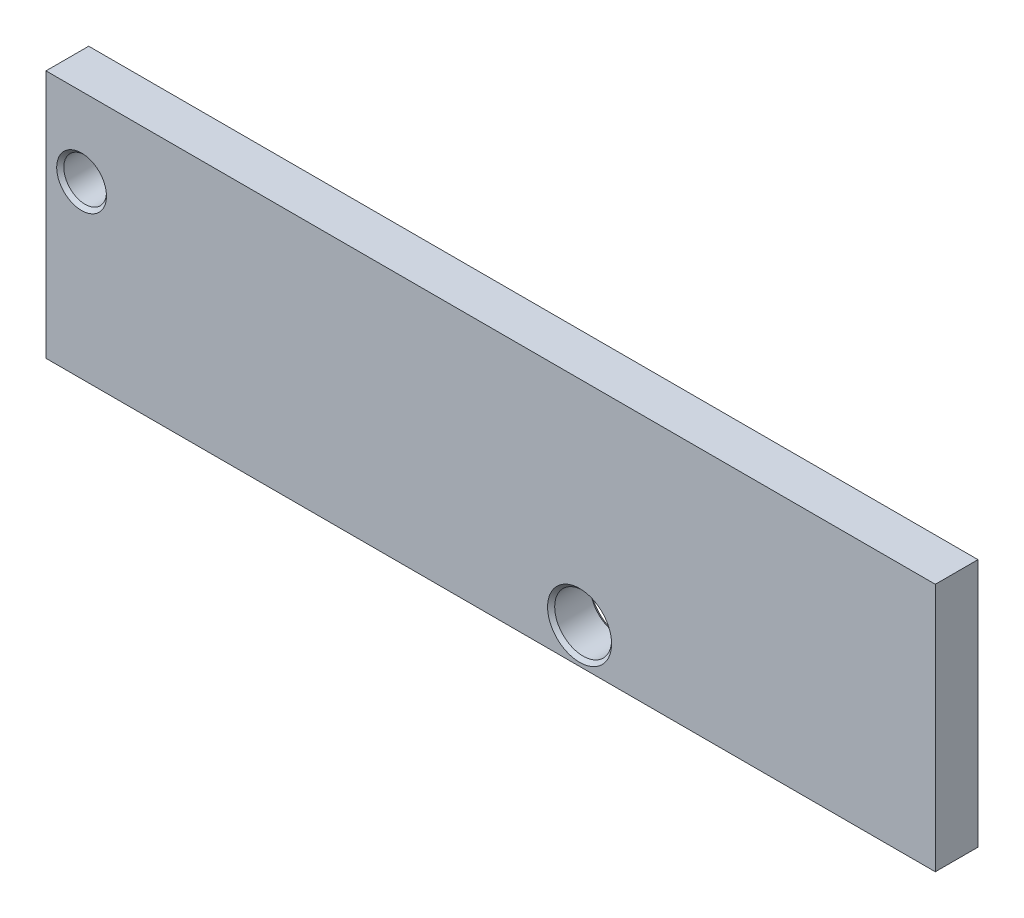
ISO-10303-21;
HEADER;
FILE_DESCRIPTION(('STEP AP214'),'2;1');
FILE_NAME('part.step','',(''),(''),'','','');
FILE_SCHEMA(('AUTOMOTIVE_DESIGN { 1 0 10303 214 1 1 1 1 }'));
ENDSEC;
DATA;
#1=APPLICATION_CONTEXT('core data for automotive mechanical design processes');
#2=APPLICATION_PROTOCOL_DEFINITION('international standard','automotive_design',2000,#1);
#3=PRODUCT_CONTEXT('',#1,'mechanical');
#4=PRODUCT('Part','Part','',(#3));
#5=PRODUCT_RELATED_PRODUCT_CATEGORY('part','',(#4));
#6=PRODUCT_DEFINITION_FORMATION('','',#4);
#7=PRODUCT_DEFINITION_CONTEXT('part definition',#1,'design');
#8=PRODUCT_DEFINITION('design','',#6,#7);
#9=PRODUCT_DEFINITION_SHAPE('','',#8);
#10=(LENGTH_UNIT() NAMED_UNIT(*) SI_UNIT(.MILLI.,.METRE.));
#11=(NAMED_UNIT(*) PLANE_ANGLE_UNIT() SI_UNIT($,.RADIAN.));
#12=(NAMED_UNIT(*) SI_UNIT($,.STERADIAN.) SOLID_ANGLE_UNIT());
#13=UNCERTAINTY_MEASURE_WITH_UNIT(LENGTH_MEASURE(1.E-05),#10,'distance_accuracy_value','');
#14=(GEOMETRIC_REPRESENTATION_CONTEXT(3) GLOBAL_UNCERTAINTY_ASSIGNED_CONTEXT((#13)) GLOBAL_UNIT_ASSIGNED_CONTEXT((#10,
#11,#12)) REPRESENTATION_CONTEXT('',''));
#15=CARTESIAN_POINT('',(0.,0.,0.));
#16=DIRECTION('',(0.,0.,1.));
#17=DIRECTION('',(1.,0.,0.));
#18=AXIS2_PLACEMENT_3D('',#15,#16,#17);
#19=CARTESIAN_POINT('',(100.,-10.,72.));
#20=DIRECTION('',(-1.,0.,0.));
#21=DIRECTION('',(0.,0.,1.));
#22=AXIS2_PLACEMENT_3D('',#19,#20,#21);
#23=PLANE('',#22);
#24=DIRECTION('',(0.,1.,0.));
#25=VECTOR('',#24,1.);
#26=CARTESIAN_POINT('',(100.,-10.,60.));
#27=LINE('',#26,#25);
#28=CARTESIAN_POINT('',(100.,-10.,60.));
#29=VERTEX_POINT('',#28);
#30=CARTESIAN_POINT('',(100.,60.,60.));
#31=VERTEX_POINT('',#30);
#32=EDGE_CURVE('E108',#29,#31,#27,.T.);
#33=ORIENTED_EDGE('',*,*,#32,.T.);
#34=DIRECTION('',(0.,0.,-1.));
#35=VECTOR('',#34,1.);
#36=CARTESIAN_POINT('',(100.,60.,72.));
#37=LINE('',#36,#35);
#38=CARTESIAN_POINT('',(100.,60.,72.));
#39=VERTEX_POINT('',#38);
#40=EDGE_CURVE('E132',#39,#31,#37,.T.);
#41=ORIENTED_EDGE('',*,*,#40,.F.);
#42=DIRECTION('',(0.,1.,0.));
#43=VECTOR('',#42,1.);
#44=CARTESIAN_POINT('',(100.,-10.,72.));
#45=LINE('',#44,#43);
#46=CARTESIAN_POINT('',(100.,-10.,72.));
#47=VERTEX_POINT('',#46);
#48=EDGE_CURVE('E117',#47,#39,#45,.T.);
#49=ORIENTED_EDGE('',*,*,#48,.F.);
#50=DIRECTION('',(0.,0.,-1.));
#51=VECTOR('',#50,1.);
#52=CARTESIAN_POINT('',(100.,-10.,72.));
#53=LINE('',#52,#51);
#54=EDGE_CURVE('E123',#47,#29,#53,.T.);
#55=ORIENTED_EDGE('',*,*,#54,.T.);
#56=EDGE_LOOP('',(#33,#41,#49,#55));
#57=FACE_BOUND('',#56,.T.);
#58=ADVANCED_FACE('F44',(#57),#23,.F.);
#59=CARTESIAN_POINT('',(100.,60.,72.));
#60=DIRECTION('',(0.,-1.,0.));
#61=DIRECTION('',(1.,0.,0.));
#62=AXIS2_PLACEMENT_3D('',#59,#60,#61);
#63=PLANE('',#62);
#64=DIRECTION('',(-1.,0.,0.));
#65=VECTOR('',#64,1.);
#66=CARTESIAN_POINT('',(100.,60.,60.));
#67=LINE('',#66,#65);
#68=CARTESIAN_POINT('',(-150.,60.,60.));
#69=VERTEX_POINT('',#68);
#70=EDGE_CURVE('E111',#31,#69,#67,.T.);
#71=ORIENTED_EDGE('',*,*,#70,.T.);
#72=DIRECTION('',(0.,0.,-1.));
#73=VECTOR('',#72,1.);
#74=CARTESIAN_POINT('',(-150.,60.,72.));
#75=LINE('',#74,#73);
#76=CARTESIAN_POINT('',(-150.,60.,72.));
#77=VERTEX_POINT('',#76);
#78=EDGE_CURVE('E129',#77,#69,#75,.T.);
#79=ORIENTED_EDGE('',*,*,#78,.F.);
#80=DIRECTION('',(-1.,0.,0.));
#81=VECTOR('',#80,1.);
#82=CARTESIAN_POINT('',(100.,60.,72.));
#83=LINE('',#82,#81);
#84=EDGE_CURVE('E119',#39,#77,#83,.T.);
#85=ORIENTED_EDGE('',*,*,#84,.F.);
#86=ORIENTED_EDGE('',*,*,#40,.T.);
#87=EDGE_LOOP('',(#71,#79,#85,#86));
#88=FACE_BOUND('',#87,.T.);
#89=ADVANCED_FACE('F182',(#88),#63,.F.);
#90=CARTESIAN_POINT('',(-150.,60.,72.));
#91=DIRECTION('',(1.,0.,0.));
#92=DIRECTION('',(0.,1.,0.));
#93=AXIS2_PLACEMENT_3D('',#90,#91,#92);
#94=PLANE('',#93);
#95=DIRECTION('',(0.,-1.,0.));
#96=VECTOR('',#95,1.);
#97=CARTESIAN_POINT('',(-150.,60.,60.));
#98=LINE('',#97,#96);
#99=CARTESIAN_POINT('',(-150.,-10.,60.));
#100=VERTEX_POINT('',#99);
#101=EDGE_CURVE('E113',#69,#100,#98,.T.);
#102=ORIENTED_EDGE('',*,*,#101,.T.);
#103=DIRECTION('',(0.,0.,-1.));
#104=VECTOR('',#103,1.);
#105=CARTESIAN_POINT('',(-150.,-10.,72.));
#106=LINE('',#105,#104);
#107=CARTESIAN_POINT('',(-150.,-10.,72.));
#108=VERTEX_POINT('',#107);
#109=EDGE_CURVE('E126',#108,#100,#106,.T.);
#110=ORIENTED_EDGE('',*,*,#109,.F.);
#111=DIRECTION('',(0.,-1.,0.));
#112=VECTOR('',#111,1.);
#113=CARTESIAN_POINT('',(-150.,60.,72.));
#114=LINE('',#113,#112);
#115=EDGE_CURVE('E63',#77,#108,#114,.T.);
#116=ORIENTED_EDGE('',*,*,#115,.F.);
#117=ORIENTED_EDGE('',*,*,#78,.T.);
#118=EDGE_LOOP('',(#102,#110,#116,#117));
#119=FACE_BOUND('',#118,.T.);
#120=ADVANCED_FACE('F187',(#119),#94,.F.);
#121=CARTESIAN_POINT('',(-150.,-10.,72.));
#122=DIRECTION('',(0.,1.,0.));
#123=DIRECTION('',(0.,0.,1.));
#124=AXIS2_PLACEMENT_3D('',#121,#122,#123);
#125=PLANE('',#124);
#126=CARTESIAN_POINT('',(50.,-10.,66.));
#127=DIRECTION('',(0.,-1.,0.));
#128=DIRECTION('',(0.,0.,-1.));
#129=AXIS2_PLACEMENT_3D('',#126,#127,#128);
#130=CIRCLE('',#129,2.09999999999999);
#131=CARTESIAN_POINT('',(50.,-10.,63.9));
#132=VERTEX_POINT('',#131);
#133=EDGE_CURVE('E97',#132,#132,#130,.T.);
#134=ORIENTED_EDGE('',*,*,#133,.F.);
#135=EDGE_LOOP('',(#134));
#136=FACE_BOUND('',#135,.T.);
#137=CARTESIAN_POINT('',(80.,-10.,66.));
#138=DIRECTION('',(0.,-1.,0.));
#139=DIRECTION('',(0.,0.,-1.));
#140=AXIS2_PLACEMENT_3D('',#137,#138,#139);
#141=CIRCLE('',#140,2.09999999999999);
#142=CARTESIAN_POINT('',(80.,-10.,63.9));
#143=VERTEX_POINT('',#142);
#144=EDGE_CURVE('E105',#143,#143,#141,.T.);
#145=ORIENTED_EDGE('',*,*,#144,.F.);
#146=EDGE_LOOP('',(#145));
#147=FACE_BOUND('',#146,.T.);
#148=DIRECTION('',(1.,0.,0.));
#149=VECTOR('',#148,1.);
#150=CARTESIAN_POINT('',(-150.,-10.,60.));
#151=LINE('',#150,#149);
#152=EDGE_CURVE('E115',#100,#29,#151,.T.);
#153=ORIENTED_EDGE('',*,*,#152,.T.);
#154=ORIENTED_EDGE('',*,*,#54,.F.);
#155=DIRECTION('',(1.,0.,0.));
#156=VECTOR('',#155,1.);
#157=CARTESIAN_POINT('',(-150.,-10.,72.));
#158=LINE('',#157,#156);
#159=EDGE_CURVE('E58',#108,#47,#158,.T.);
#160=ORIENTED_EDGE('',*,*,#159,.F.);
#161=ORIENTED_EDGE('',*,*,#109,.T.);
#162=EDGE_LOOP('',(#153,#154,#160,#161));
#163=FACE_BOUND('',#162,.T.);
#164=ADVANCED_FACE('F197',(#136,#147,#163),#125,.F.);
#165=CARTESIAN_POINT('',(100.,-10.,72.));
#166=DIRECTION('',(0.,0.,-1.));
#167=DIRECTION('',(-1.,0.,0.));
#168=AXIS2_PLACEMENT_3D('',#165,#166,#167);
#169=PLANE('',#168);
#170=CARTESIAN_POINT('',(0.,0.,72.));
#171=DIRECTION('',(0.,0.,-1.));
#172=DIRECTION('',(-1.,0.,0.));
#173=AXIS2_PLACEMENT_3D('',#170,#171,#172);
#174=CIRCLE('',#173,9.);
#175=CARTESIAN_POINT('',(-9.,0.,72.));
#176=VERTEX_POINT('',#175);
#177=EDGE_CURVE('E13',#176,#176,#174,.T.);
#178=ORIENTED_EDGE('',*,*,#177,.T.);
#179=EDGE_LOOP('',(#178));
#180=FACE_BOUND('',#179,.T.);
#181=CARTESIAN_POINT('',(-140.,38.,72.));
#182=DIRECTION('',(0.,0.,-1.));
#183=DIRECTION('',(-1.,0.,0.));
#184=AXIS2_PLACEMENT_3D('',#181,#182,#183);
#185=CIRCLE('',#184,7.00000000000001);
#186=CARTESIAN_POINT('',(-147.,38.,72.));
#187=VERTEX_POINT('',#186);
#188=EDGE_CURVE('E51',#187,#187,#185,.T.);
#189=ORIENTED_EDGE('',*,*,#188,.T.);
#190=EDGE_LOOP('',(#189));
#191=FACE_BOUND('',#190,.T.);
#192=ORIENTED_EDGE('',*,*,#48,.T.);
#193=ORIENTED_EDGE('',*,*,#84,.T.);
#194=ORIENTED_EDGE('',*,*,#115,.T.);
#195=ORIENTED_EDGE('',*,*,#159,.T.);
#196=EDGE_LOOP('',(#192,#193,#194,#195));
#197=FACE_BOUND('',#196,.T.);
#198=ADVANCED_FACE('F155',(#180,#191,#197),#169,.F.);
#199=CARTESIAN_POINT('',(100.,-10.,60.));
#200=DIRECTION('',(0.,0.,-1.));
#201=DIRECTION('',(-1.,0.,0.));
#202=AXIS2_PLACEMENT_3D('',#199,#200,#201);
#203=PLANE('',#202);
#204=CARTESIAN_POINT('',(0.,0.,60.));
#205=DIRECTION('',(0.,0.,-1.));
#206=DIRECTION('',(-1.,0.,0.));
#207=AXIS2_PLACEMENT_3D('',#204,#205,#206);
#208=CIRCLE('',#207,9.);
#209=CARTESIAN_POINT('',(-9.,0.,60.));
#210=VERTEX_POINT('',#209);
#211=EDGE_CURVE('E138',#210,#210,#208,.F.);
#212=ORIENTED_EDGE('',*,*,#211,.T.);
#213=EDGE_LOOP('',(#212));
#214=FACE_BOUND('',#213,.T.);
#215=CARTESIAN_POINT('',(-140.,38.,60.));
#216=DIRECTION('',(0.,0.,-1.));
#217=DIRECTION('',(-1.,0.,0.));
#218=AXIS2_PLACEMENT_3D('',#215,#216,#217);
#219=CIRCLE('',#218,7.00000000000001);
#220=CARTESIAN_POINT('',(-147.,38.,60.));
#221=VERTEX_POINT('',#220);
#222=EDGE_CURVE('E135',#221,#221,#219,.F.);
#223=ORIENTED_EDGE('',*,*,#222,.T.);
#224=EDGE_LOOP('',(#223));
#225=FACE_BOUND('',#224,.T.);
#226=ORIENTED_EDGE('',*,*,#32,.F.);
#227=ORIENTED_EDGE('',*,*,#152,.F.);
#228=ORIENTED_EDGE('',*,*,#101,.F.);
#229=ORIENTED_EDGE('',*,*,#70,.F.);
#230=EDGE_LOOP('',(#226,#227,#228,#229));
#231=FACE_BOUND('',#230,.T.);
#232=ADVANCED_FACE('F178',(#214,#225,#231),#203,.T.);
#233=CARTESIAN_POINT('',(0.,0.,59.999));
#234=DIRECTION('',(0.,0.,1.));
#235=DIRECTION('',(1.,0.,0.));
#236=AXIS2_PLACEMENT_3D('',#233,#234,#235);
#237=CYLINDRICAL_SURFACE('',#236,8.);
#238=CARTESIAN_POINT('',(0.,0.,61.));
#239=DIRECTION('',(0.,0.,-1.));
#240=DIRECTION('',(-1.,0.,0.));
#241=AXIS2_PLACEMENT_3D('',#238,#239,#240);
#242=CIRCLE('',#241,8.);
#243=CARTESIAN_POINT('',(-8.,0.,61.));
#244=VERTEX_POINT('',#243);
#245=EDGE_CURVE('E144',#244,#244,#242,.T.);
#246=ORIENTED_EDGE('',*,*,#245,.T.);
#247=EDGE_LOOP('',(#246));
#248=FACE_BOUND('',#247,.T.);
#249=CARTESIAN_POINT('',(0.,0.,71.));
#250=DIRECTION('',(0.,0.,-1.));
#251=DIRECTION('',(-1.,0.,0.));
#252=AXIS2_PLACEMENT_3D('',#249,#250,#251);
#253=CIRCLE('',#252,8.);
#254=CARTESIAN_POINT('',(-8.,0.,71.));
#255=VERTEX_POINT('',#254);
#256=EDGE_CURVE('E141',#255,#255,#253,.F.);
#257=ORIENTED_EDGE('',*,*,#256,.T.);
#258=EDGE_LOOP('',(#257));
#259=FACE_BOUND('',#258,.T.);
#260=ADVANCED_FACE('F168',(#248,#259),#237,.F.);
#261=CARTESIAN_POINT('',(-140.,38.,59.999));
#262=DIRECTION('',(0.,0.,1.));
#263=DIRECTION('',(1.,0.,0.));
#264=AXIS2_PLACEMENT_3D('',#261,#262,#263);
#265=CYLINDRICAL_SURFACE('',#264,6.00000000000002);
#266=CARTESIAN_POINT('',(-140.,38.,61.));
#267=DIRECTION('',(0.,0.,-1.));
#268=DIRECTION('',(-1.,0.,0.));
#269=AXIS2_PLACEMENT_3D('',#266,#267,#268);
#270=CIRCLE('',#269,6.00000000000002);
#271=CARTESIAN_POINT('',(-146.,38.,61.));
#272=VERTEX_POINT('',#271);
#273=EDGE_CURVE('E150',#272,#272,#270,.T.);
#274=ORIENTED_EDGE('',*,*,#273,.T.);
#275=EDGE_LOOP('',(#274));
#276=FACE_BOUND('',#275,.T.);
#277=CARTESIAN_POINT('',(-140.,38.,71.));
#278=DIRECTION('',(0.,0.,-1.));
#279=DIRECTION('',(-1.,0.,0.));
#280=AXIS2_PLACEMENT_3D('',#277,#278,#279);
#281=CIRCLE('',#280,6.00000000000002);
#282=CARTESIAN_POINT('',(-146.,38.,71.));
#283=VERTEX_POINT('',#282);
#284=EDGE_CURVE('E147',#283,#283,#281,.F.);
#285=ORIENTED_EDGE('',*,*,#284,.T.);
#286=EDGE_LOOP('',(#285));
#287=FACE_BOUND('',#286,.T.);
#288=ADVANCED_FACE('F165',(#276,#287),#265,.F.);
#289=CARTESIAN_POINT('',(0.,0.,60.));
#290=DIRECTION('',(0.,0.,-1.));
#291=DIRECTION('',(-1.,0.,0.));
#292=AXIS2_PLACEMENT_3D('',#289,#290,#291);
#293=CONICAL_SURFACE('',#292,9.,0.785398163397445);
#294=ORIENTED_EDGE('',*,*,#245,.F.);
#295=EDGE_LOOP('',(#294));
#296=FACE_BOUND('',#295,.T.);
#297=ORIENTED_EDGE('',*,*,#211,.F.);
#298=EDGE_LOOP('',(#297));
#299=FACE_BOUND('',#298,.T.);
#300=ADVANCED_FACE('F167',(#296,#299),#293,.F.);
#301=CARTESIAN_POINT('',(-140.,38.,60.));
#302=DIRECTION('',(0.,0.,-1.));
#303=DIRECTION('',(-1.,0.,0.));
#304=AXIS2_PLACEMENT_3D('',#301,#302,#303);
#305=CONICAL_SURFACE('',#304,7.00000000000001,0.78539816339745);
#306=ORIENTED_EDGE('',*,*,#273,.F.);
#307=EDGE_LOOP('',(#306));
#308=FACE_BOUND('',#307,.T.);
#309=ORIENTED_EDGE('',*,*,#222,.F.);
#310=EDGE_LOOP('',(#309));
#311=FACE_BOUND('',#310,.T.);
#312=ADVANCED_FACE('F175',(#308,#311),#305,.F.);
#313=CARTESIAN_POINT('',(0.,0.,71.));
#314=DIRECTION('',(0.,0.,1.));
#315=DIRECTION('',(1.,0.,0.));
#316=AXIS2_PLACEMENT_3D('',#313,#314,#315);
#317=CONICAL_SURFACE('',#316,8.,0.785398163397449);
#318=ORIENTED_EDGE('',*,*,#177,.F.);
#319=EDGE_LOOP('',(#318));
#320=FACE_BOUND('',#319,.T.);
#321=ORIENTED_EDGE('',*,*,#256,.F.);
#322=EDGE_LOOP('',(#321));
#323=FACE_BOUND('',#322,.T.);
#324=ADVANCED_FACE('F161',(#320,#323),#317,.F.);
#325=CARTESIAN_POINT('',(-140.,38.,71.));
#326=DIRECTION('',(0.,0.,1.));
#327=DIRECTION('',(1.,0.,0.));
#328=AXIS2_PLACEMENT_3D('',#325,#326,#327);
#329=CONICAL_SURFACE('',#328,6.00000000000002,0.785398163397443);
#330=ORIENTED_EDGE('',*,*,#188,.F.);
#331=EDGE_LOOP('',(#330));
#332=FACE_BOUND('',#331,.T.);
#333=ORIENTED_EDGE('',*,*,#284,.F.);
#334=EDGE_LOOP('',(#333));
#335=FACE_BOUND('',#334,.T.);
#336=ADVANCED_FACE('F157',(#332,#335),#329,.F.);
#337=CARTESIAN_POINT('',(80.,-10.,66.));
#338=DIRECTION('',(0.,-1.,0.));
#339=DIRECTION('',(0.,0.,-1.));
#340=AXIS2_PLACEMENT_3D('',#337,#338,#339);
#341=CYLINDRICAL_SURFACE('',#340,2.09999999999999);
#342=CARTESIAN_POINT('',(80.,2.39999999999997,66.));
#343=DIRECTION('',(0.,-1.,0.));
#344=DIRECTION('',(0.,0.,-1.));
#345=AXIS2_PLACEMENT_3D('',#342,#343,#344);
#346=CIRCLE('',#345,2.09999999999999);
#347=CARTESIAN_POINT('',(80.,2.39999999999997,63.9));
#348=VERTEX_POINT('',#347);
#349=EDGE_CURVE('E100',#348,#348,#346,.T.);
#350=ORIENTED_EDGE('',*,*,#349,.F.);
#351=EDGE_LOOP('',(#350));
#352=FACE_BOUND('',#351,.T.);
#353=ORIENTED_EDGE('',*,*,#144,.T.);
#354=EDGE_LOOP('',(#353));
#355=FACE_BOUND('',#354,.T.);
#356=ADVANCED_FACE('F160',(#352,#355),#341,.F.);
#357=CARTESIAN_POINT('',(80.,2.39999999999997,66.));
#358=DIRECTION('',(0.,-1.,0.));
#359=DIRECTION('',(0.,0.,-1.));
#360=AXIS2_PLACEMENT_3D('',#357,#358,#359);
#361=CONICAL_SURFACE('',#360,2.09999999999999,1.02974425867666);
#362=CARTESIAN_POINT('',(80.,3.66180729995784,66.));
#363=VERTEX_POINT('',#362);
#364=VERTEX_LOOP('',#363);
#365=FACE_BOUND('',#364,.T.);
#366=ORIENTED_EDGE('',*,*,#349,.T.);
#367=EDGE_LOOP('',(#366));
#368=FACE_BOUND('',#367,.T.);
#369=ADVANCED_FACE('F233',(#365,#368),#361,.F.);
#370=CARTESIAN_POINT('',(50.,-10.,66.));
#371=DIRECTION('',(0.,-1.,0.));
#372=DIRECTION('',(0.,0.,-1.));
#373=AXIS2_PLACEMENT_3D('',#370,#371,#372);
#374=CYLINDRICAL_SURFACE('',#373,2.09999999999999);
#375=CARTESIAN_POINT('',(50.,2.39999999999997,66.));
#376=DIRECTION('',(0.,-1.,0.));
#377=DIRECTION('',(0.,0.,-1.));
#378=AXIS2_PLACEMENT_3D('',#375,#376,#377);
#379=CIRCLE('',#378,2.09999999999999);
#380=CARTESIAN_POINT('',(50.,2.39999999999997,63.9));
#381=VERTEX_POINT('',#380);
#382=EDGE_CURVE('E95',#381,#381,#379,.T.);
#383=ORIENTED_EDGE('',*,*,#382,.F.);
#384=EDGE_LOOP('',(#383));
#385=FACE_BOUND('',#384,.T.);
#386=ORIENTED_EDGE('',*,*,#133,.T.);
#387=EDGE_LOOP('',(#386));
#388=FACE_BOUND('',#387,.T.);
#389=ADVANCED_FACE('F91',(#385,#388),#374,.F.);
#390=CARTESIAN_POINT('',(50.,2.39999999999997,66.));
#391=DIRECTION('',(0.,-1.,0.));
#392=DIRECTION('',(0.,0.,-1.));
#393=AXIS2_PLACEMENT_3D('',#390,#391,#392);
#394=CONICAL_SURFACE('',#393,2.09999999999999,1.02974425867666);
#395=CARTESIAN_POINT('',(50.,3.66180729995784,66.));
#396=VERTEX_POINT('',#395);
#397=VERTEX_LOOP('',#396);
#398=FACE_BOUND('',#397,.T.);
#399=ORIENTED_EDGE('',*,*,#382,.T.);
#400=EDGE_LOOP('',(#399));
#401=FACE_BOUND('',#400,.T.);
#402=ADVANCED_FACE('F88',(#398,#401),#394,.F.);
#403=CLOSED_SHELL('',(#58,#89,#120,#164,#198,#232,#260,#288,#300,#312,#324,#336,#356,#369,#389,#402));
#404=MANIFOLD_SOLID_BREP('B2',#403);
#405=ADVANCED_BREP_SHAPE_REPRESENTATION('',(#18,#404),#14);
#406=SHAPE_DEFINITION_REPRESENTATION(#9,#405);
ENDSEC;
END-ISO-10303-21;
